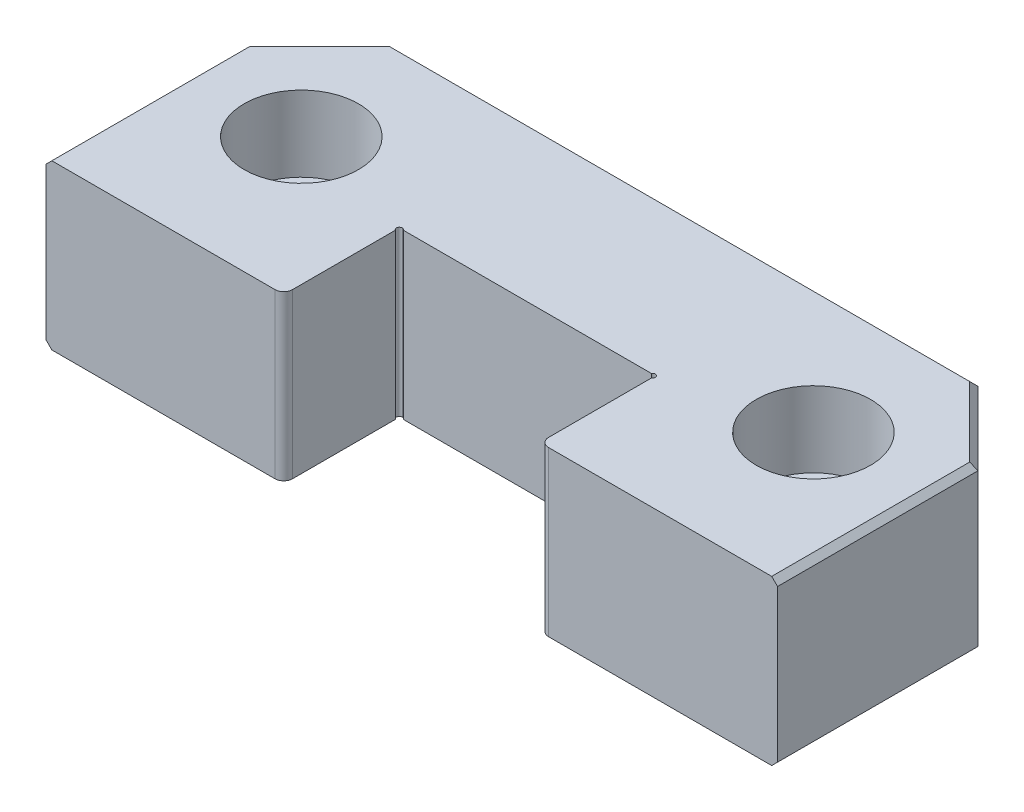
from build123d import *

# Parameters (mm, degrees)
SKETCH2_W               = 127
SKETCH2_H               = 47.498
EXTRUDE1_DEPTH          = 28.448
CHAMFER1_SIZE           = 12.7
CUT_EXTRUDE1_DEPTH      = 22.86
CUT_EXTRUDE1_DEPTH_BACK = 85.24724748
FILLET1_R               = 1.524
SKETCH4_R               = 6.7437
CUT_EXTRUDE2_DEPTH      = 15.748
CUT_EXTRUDE3_START      = -28.448
SKETCH5_R               = 9.9187
CUT_EXTRUDE3_DEPTH      = 13.1064
CHAMFER2_SIZE           = 1.016


with BuildPart() as part:
    # Sketch2 → Extrude1 (new body)
    with BuildSketch(Plane(origin=(0, 0, 0), x_dir=(1, 0, 0), z_dir=(0, 1, 0))):
        with Locations((0, 23.749)):
            Rectangle(SKETCH2_W, SKETCH2_H)
    extrude(amount=EXTRUDE1_DEPTH)

    # Chamfer1
    chamfer1_edges = [part.edges().sort_by_distance(p)[0] for p in [
        (-63.5, 14.224, -47.498),
        (63.5, 14.224, -47.498),
    ]]
    chamfer(chamfer1_edges, length=CHAMFER1_SIZE)

    # Sketch3 → Cut-Extrude1 (cut, two sides: drawn at the far end of the back side and taken through both)
    with BuildSketch(Plane.XZ.offset(-CUT_EXTRUDE1_DEPTH_BACK)):
        with BuildLine():
            Line((-21.531059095, -20.066), (21.531059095, -20.066))
            ThreePointArc((21.531059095, -20.066), (22.330210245, -20.171210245), (22.225, -19.372059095))
            Line((22.225, -19.372059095), (22.225, 1.558776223))
            Line((22.225, 1.558776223), (-22.225, 1.558776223))
            Line((-22.225, 1.558776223), (-22.225, -19.372059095))
            ThreePointArc((-22.225, -19.372059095), (-22.330210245, -20.171210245), (-21.531059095, -20.066))
        make_face()
    extrude(amount=CUT_EXTRUDE1_DEPTH + CUT_EXTRUDE1_DEPTH_BACK, mode=Mode.SUBTRACT)

    # Fillet1
    fillet1_edges = [part.edges().sort_by_distance(p)[0] for p in [
        (22.225, 14.224, 0),
        (-22.225, 14.224, 0),
    ]]
    fillet(fillet1_edges, radius=FILLET1_R)

    # Sketch4 → Cut-Extrude2 (cut)
    with BuildSketch(Plane.XZ):
        with Locations(Location((44.45, -25.273, 0), (0, 0, 270))):
            Circle(SKETCH4_R)
        with Locations(Location((-44.45, -25.273, 0), (0, 0, 270))):
            Circle(SKETCH4_R)
    extrude(amount=-CUT_EXTRUDE2_DEPTH, mode=Mode.SUBTRACT)

    # Sketch5 → Cut-Extrude3 (cut)
    with BuildSketch(Plane.XZ.offset(CUT_EXTRUDE3_START)):
        with Locations(Location((44.45, -25.273, 0), (0, 0, 90))):
            Circle(SKETCH5_R)
        with Locations(Location((-44.45, -25.273, 0), (0, 0, 90))):
            Circle(SKETCH5_R)
    extrude(amount=CUT_EXTRUDE3_DEPTH, mode=Mode.SUBTRACT)

    # Chamfer2
    chamfer2_edges = [part.edges().sort_by_distance(p)[0] for p in [
        (63.5, 28.448, -17.399),
        (0, 0, -47.498),
        (0, 28.448, -47.498),
        (-63.5, 0, -17.399),
        (-57.15, 0, -41.148),
        (57.15, 0, -41.148),
        (-63.5, 28.448, -17.399),
        (-57.15, 28.448, -41.148),
        (57.15, 28.448, -41.148),
        (63.5, 0, -17.399),
    ]]
    chamfer(chamfer2_edges, length=CHAMFER2_SIZE)


solid = part.part
